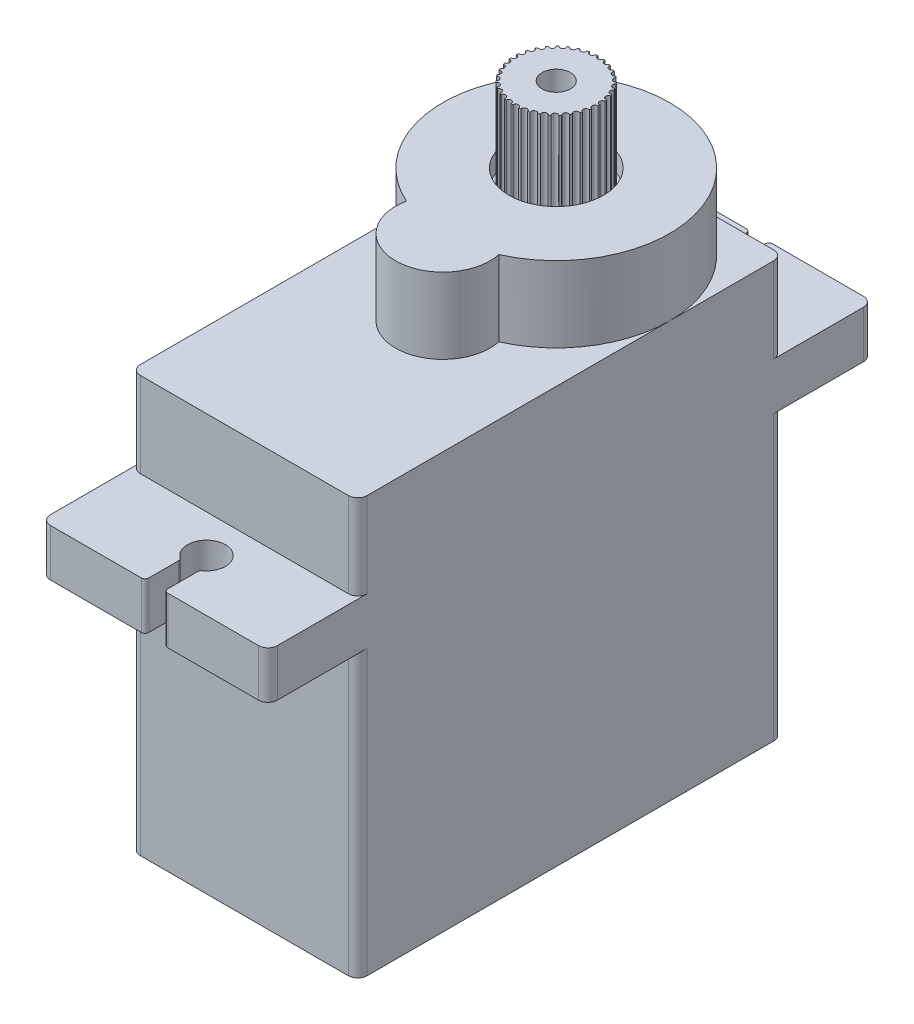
from build123d import *

# Parameters (mm, degrees)
Y_KSEKLIK_EKSTR_ZYON1_DEPTH  = 1
Y_KSEKLIK_EKSTR_ZYON2_DEPTH  = 5
IZIM3_W                      = 4
IZIM3_H                      = 1
KES_EKSTR_ZYON1_DEPTH        = 1
RADYUS1_R                    = 0.1
Y_KSEKLIK_EKSTR_ZYON4_DEPTH  = 9
Y_KSEKLIK_EKSTR_ZYON5_DEPTH  = 2.5
Y_KSEKLIK_EKSTR_ZYON6_DEPTH  = 3.5
Y_KSEKLIK_EKSTR_ZYON7_DEPTH  = 1
KES_EKSTR_ZYON2_DEPTH        = 1
Y_KSEKLIK_EKSTR_ZYON8_START  = 3
Y_KSEKLIK_EKSTR_ZYON8_DEPTH  = 3
RADYUS2_R                    = 0.5
Y_KSEKLIK_EKSTR_ZYON9_START  = 1
Y_KSEKLIK_EKSTR_ZYON9_DEPTH  = 1
IZIM11_R                     = 2.5
KES_EKSTR_ZYON3_DEPTH        = 10
IZIM15_R                     = 0.25
Y_KSEKLIK_EKSTR_ZYON12_DEPTH = 11
IZIM19_R                     = 2.25
Y_KSEKLIK_EKSTR_ZYON17_DEPTH = 5
IZIM20_R                     = 4.75
Y_KSEKLIK_EKSTR_ZYON18_DEPTH = 3
IZIM21_R                     = 0.75
KES_EKSTR_ZYON5_DEPTH        = 10
IZIM22_R                     = 0.5
Y_KSEKLIK_EKSTR_ZYON19_DEPTH = 5
IZIM23_R                     = 4
Y_KSEKLIK_EKSTR_ZYON20_DEPTH = 2
IZIM24_R                     = 0.75
Y_KSEKLIK_EKSTR_ZYON21_DEPTH = 7
IZIM25_R                     = 3.5
Y_KSEKLIK_EKSTR_ZYON22_DEPTH = 1
IZIM26_R                     = 4.5
Y_KSEKLIK_EKSTR_ZYON23_DEPTH = 1
KES_EKSTR_ZYON7_DEPTH        = 30
Y_KSEKLIK_EKSTR_ZYON33_DEPTH = 1
Y_KSEKLIK_EKSTR_ZYON34_DEPTH = 14
IZIM37_W                     = 8
IZIM37_H                     = 6
Y_KSEKLIK_EKSTR_ZYON36_DEPTH = 1
IZIM39_W                     = 4
IZIM39_H                     = 1
Y_KSEKLIK_EKSTR_ZYON37_DEPTH = 0.1
IZIM40_R                     = 0.4
Y_KSEKLIK_EKSTR_ZYON38_DEPTH = 2
IZIM41_R                     = 0.15
KES_EKSTR_ZYON8_DEPTH        = 5


with BuildPart() as part:
    # izim1 → Y_kseklik-Ekstr_zyon1 (new body)
    with BuildSketch(Plane(origin=(0, 0, 0), x_dir=(1, 0, 0), z_dir=(0, 1, 0))):
        with BuildLine():
            Line((-5.5, 11.25), (5.5, 11.25))
            ThreePointArc((5.5, 11.25), (5.853553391, 11.103553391), (6, 10.75))
            Line((6, 10.75), (6, -10.75))
            ThreePointArc((6, -10.75), (5.853553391, -11.103553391), (5.5, -11.25))
            Line((5.5, -11.25), (-5.5, -11.25))
            ThreePointArc((-5.5, -11.25), (-5.853553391, -11.103553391), (-6, -10.75))
            Line((-6, -10.75), (-6, 10.75))
            ThreePointArc((-6, 10.75), (-5.853553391, 11.103553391), (-5.5, 11.25))
        make_face()
    extrude(amount=Y_KSEKLIK_EKSTR_ZYON1_DEPTH)

    # izim2 → Y_kseklik-Ekstr_zyon2 (add)
    with BuildSketch(Plane(origin=(0, 1, 0), x_dir=(1, 0, 0), z_dir=(0, 1, 0))):
        with BuildLine():
            Line((-5.5, 11.25), (5.5, 11.25))
            ThreePointArc((5.5, 11.25), (5.853553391, 11.103553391), (6, 10.75))
            Line((6, 10.75), (6, -10.75))
            ThreePointArc((6, -10.75), (5.853553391, -11.103553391), (5.5, -11.25))
            Line((5.5, -11.25), (-5.5, -11.25))
            ThreePointArc((-5.5, -11.25), (-5.853553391, -11.103553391), (-6, -10.75))
            Line((-6, -10.75), (-6, 10.75))
            ThreePointArc((-6, 10.75), (-5.853553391, 11.103553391), (-5.5, 11.25))
        make_face()
        with BuildLine():
            Line((-5, 9.25), (-5, -9.25))
            ThreePointArc((-5, -9.25), (-4.292893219, -9.542893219), (-4, -10.25))
            Line((-4, -10.25), (4, -10.25))
            ThreePointArc((4, -10.25), (4.292893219, -9.542893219), (5, -9.25))
            Line((5, -9.25), (5, 9.25))
            ThreePointArc((5, 9.25), (4.292893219, 9.542893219), (4, 10.25))
            Line((4, 10.25), (-4, 10.25))
            ThreePointArc((-4, 10.25), (-4.292893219, 9.542893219), (-5, 9.25))
        make_face(mode=Mode.SUBTRACT)
    extrude(amount=Y_KSEKLIK_EKSTR_ZYON2_DEPTH)

    # izim3 → Kes-Ekstr_zyon1 (cut)
    with BuildSketch(Plane(origin=(0, 6, 0), x_dir=(1, 0, 0), z_dir=(0, 1, 0))):
        with Locations((0, -10.75)):
            Rectangle(IZIM3_W, IZIM3_H)
    extrude(amount=-KES_EKSTR_ZYON1_DEPTH, mode=Mode.SUBTRACT)

    # Radyus1
    radyus1_edges = [part.edges().sort_by_distance(p)[0] for p in [
        (2, 5, 10.75),
        (-2, 5, 10.75),
    ]]
    fillet(radyus1_edges, radius=RADYUS1_R)

    # izim4 → Y_kseklik-Ekstr_zyon4 (add)
    with BuildSketch(Plane(origin=(0, 6, 0), x_dir=(1, 0, 0), z_dir=(0, 1, 0))):
        with BuildLine():
            Line((-5.5, 11.25), (5.5, 11.25))
            ThreePointArc((5.5, 11.25), (5.853553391, 11.103553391), (6, 10.75))
            Line((6, 10.75), (6, -10.75))
            ThreePointArc((6, -10.75), (5.853553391, -11.103553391), (5.5, -11.25))
            Line((5.5, -11.25), (-5.5, -11.25))
            ThreePointArc((-5.5, -11.25), (-5.853553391, -11.103553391), (-6, -10.75))
            Line((-6, -10.75), (-6, 10.75))
            ThreePointArc((-6, 10.75), (-5.853553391, 11.103553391), (-5.5, 11.25))
        make_face()
        with BuildLine():
            Line((-4, 10.25), (4, 10.25))
            ThreePointArc((4, 10.25), (4.292893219, 9.542893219), (5, 9.25))
            Line((5, 9.25), (5, -9.25))
            ThreePointArc((5, -9.25), (4.292893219, -9.542893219), (4, -10.25))
            Line((4, -10.25), (-4, -10.25))
            ThreePointArc((-4, -10.25), (-4.292893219, -9.542893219), (-5, -9.25))
            Line((-5, -9.25), (-5, 9.25))
            ThreePointArc((-5, 9.25), (-4.292893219, 9.542893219), (-4, 10.25))
        make_face(mode=Mode.SUBTRACT)
    extrude(amount=Y_KSEKLIK_EKSTR_ZYON4_DEPTH)

    # izim6 → Y_kseklik-Ekstr_zyon5 (add)
    with BuildSketch(Plane(origin=(0, 15, 0), x_dir=(1, 0, 0), z_dir=(0, 1, 0))):
        with BuildLine():
            Line((-5.5, 16), (-0.7, 16))
            ThreePointArc((-0.7, 16), (-0.558578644, 15.941421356), (-0.5, 15.8))
            Line((-0.5, 15.8), (-0.5, 14.224679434))
            ThreePointArc((-0.5, 14.224679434), (-0.522048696, 14.133392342), (-0.583333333, 14.062232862))
            ThreePointArc((-0.583333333, 14.062232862), (0, 12.25), (0.583333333, 14.062232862))
            ThreePointArc((0.583333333, 14.062232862), (0.522048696, 14.133392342), (0.5, 14.224679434))
            Line((0.5, 14.224679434), (0.5, 15.8))
            ThreePointArc((0.5, 15.8), (0.558578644, 15.941421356), (0.7, 16))
            Line((0.7, 16), (5.5, 16))
            ThreePointArc((5.5, 16), (5.853553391, 15.853553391), (6, 15.5))
            Line((6, 15.5), (6, -15.5))
            ThreePointArc((6, -15.5), (5.853553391, -15.853553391), (5.5, -16))
            Line((5.5, -16), (0.7, -16))
            ThreePointArc((0.7, -16), (0.558578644, -15.941421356), (0.5, -15.8))
            Line((0.5, -15.8), (0.5, -14.224679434))
            ThreePointArc((0.5, -14.224679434), (0.522048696, -14.133392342), (0.583333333, -14.062232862))
            ThreePointArc((0.583333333, -14.062232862), (0, -12.25), (-0.583333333, -14.062232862))
            ThreePointArc((-0.583333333, -14.062232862), (-0.522048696, -14.133392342), (-0.5, -14.224679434))
            Line((-0.5, -14.224679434), (-0.5, -15.8))
            ThreePointArc((-0.5, -15.8), (-0.558578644, -15.941421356), (-0.7, -16))
            Line((-0.7, -16), (-5.5, -16))
            ThreePointArc((-5.5, -16), (-5.853553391, -15.853553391), (-6, -15.5))
            Line((-6, -15.5), (-6, 15.5))
            ThreePointArc((-6, 15.5), (-5.853553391, 15.853553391), (-5.5, 16))
        make_face()
        with BuildLine():
            Line((-4, 10.25), (4, 10.25))
            ThreePointArc((4, 10.25), (4.292893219, 9.542893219), (5, 9.25))
            Line((5, 9.25), (5, -9.25))
            ThreePointArc((5, -9.25), (4.292893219, -9.542893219), (4, -10.25))
            Line((4, -10.25), (-4, -10.25))
            ThreePointArc((-4, -10.25), (-4.292893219, -9.542893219), (-5, -9.25))
            Line((-5, -9.25), (-5, 9.25))
            ThreePointArc((-5, 9.25), (-4.292893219, 9.542893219), (-4, 10.25))
        make_face(mode=Mode.SUBTRACT)
    extrude(amount=Y_KSEKLIK_EKSTR_ZYON5_DEPTH)

    # izim7 → Y_kseklik-Ekstr_zyon6 (add)
    with BuildSketch(Plane(origin=(0, 17.5, 0), x_dir=(1, 0, 0), z_dir=(0, 1, 0))):
        with BuildLine():
            Line((5.5, 11.25), (-5.5, 11.25))
            ThreePointArc((-5.5, 11.25), (-5.853553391, 11.103553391), (-6, 10.75))
            Line((-6, 10.75), (-6, -10.75))
            ThreePointArc((-6, -10.75), (-5.853553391, -11.103553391), (-5.5, -11.25))
            Line((-5.5, -11.25), (5.5, -11.25))
            ThreePointArc((5.5, -11.25), (5.853553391, -11.103553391), (6, -10.75))
            Line((6, -10.75), (6, 10.75))
            ThreePointArc((6, 10.75), (5.853553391, 11.103553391), (5.5, 11.25))
        make_face()
        with BuildLine():
            Line((-5, -9.25), (-5, 9.25))
            ThreePointArc((-5, 9.25), (-4.292893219, 9.542893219), (-4, 10.25))
            Line((-4, 10.25), (4, 10.25))
            ThreePointArc((4, 10.25), (4.292893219, 9.542893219), (5, 9.25))
            Line((5, 9.25), (5, -9.25))
            ThreePointArc((5, -9.25), (4.292893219, -9.542893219), (4, -10.25))
            Line((4, -10.25), (-4, -10.25))
            ThreePointArc((-4, -10.25), (-4.292893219, -9.542893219), (-5, -9.25))
        make_face(mode=Mode.SUBTRACT)
    extrude(amount=Y_KSEKLIK_EKSTR_ZYON6_DEPTH)

    # izim8 → Y_kseklik-Ekstr_zyon7 (add)
    with BuildSketch(Plane(origin=(0, 21, 0), x_dir=(1, 0, 0), z_dir=(0, 1, 0))):
        with BuildLine():
            Line((-5.5, 11.25), (5.5, 11.25))
            ThreePointArc((5.5, 11.25), (5.853553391, 11.103553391), (6, 10.75))
            Line((6, 10.75), (6, -10.75))
            ThreePointArc((6, -10.75), (5.853553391, -11.103553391), (5.5, -11.25))
            Line((5.5, -11.25), (-5.5, -11.25))
            ThreePointArc((-5.5, -11.25), (-5.853553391, -11.103553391), (-6, -10.75))
            Line((-6, -10.75), (-6, 10.75))
            ThreePointArc((-6, 10.75), (-5.853553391, 11.103553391), (-5.5, 11.25))
        make_face()
    extrude(amount=Y_KSEKLIK_EKSTR_ZYON7_DEPTH)

    # izim9 → Kes-Ekstr_zyon2 (cut)
    with BuildSketch(Plane(origin=(0, 22, 0), x_dir=(1, 0, 0), z_dir=(0, 1, 0))):
        with BuildLine():
            ThreePointArc((1.015291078, 0.354166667), (0, 10.25), (-1.015291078, 0.354166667))
            ThreePointArc((-1.015291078, 0.354166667), (0, -2.25), (1.015291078, 0.354166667))
        make_face()
    extrude(amount=-KES_EKSTR_ZYON2_DEPTH, mode=Mode.SUBTRACT)

    # izim9_3 → Y_kseklik-Ekstr_zyon8 (add)
    with BuildSketch(Plane(origin=(0, 22, 0), x_dir=(1, 0, 0), z_dir=(0, 1, 0)).offset(Y_KSEKLIK_EKSTR_ZYON8_START)):
        with BuildLine():
            ThreePointArc((2.445144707, -0.229166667), (0, 11.25), (-2.445144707, -0.229166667))
            ThreePointArc((-2.445144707, -0.229166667), (0, -3.25), (2.445144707, -0.229166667))
        make_face()
        with BuildLine():
            ThreePointArc((1.015291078, 0.354166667), (0, 10.25), (-1.015291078, 0.354166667))
            ThreePointArc((-1.015291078, 0.354166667), (0, -2.25), (1.015291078, 0.354166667))
        make_face(mode=Mode.SUBTRACT)
    extrude(amount=-Y_KSEKLIK_EKSTR_ZYON8_DEPTH)

    # Radyus2
    radyus2_edges = [part.edges().sort_by_distance(p)[0] for p in [
        (-1.015291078, 23, -0.354166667),
        (1.015291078, 23, -0.354166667),
    ]]
    fillet(radyus2_edges, radius=RADYUS2_R)

    # izim10 → Y_kseklik-Ekstr_zyon9 (add)
    with BuildSketch(Plane(origin=(0, 25, 0), x_dir=(1, 0, 0), z_dir=(0, 1, 0)).offset(Y_KSEKLIK_EKSTR_ZYON9_START)):
        with BuildLine():
            ThreePointArc((2.445144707, -0.229166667), (0, 11.25), (-2.445144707, -0.229166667))
            ThreePointArc((-2.445144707, -0.229166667), (0, -3.25), (2.445144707, -0.229166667))
        make_face()
    extrude(amount=-Y_KSEKLIK_EKSTR_ZYON9_DEPTH)

    # izim11 → Kes-Ekstr_zyon3 (cut)
    with BuildSketch(Plane(origin=(0, 26, 0), x_dir=(1, 0, 0), z_dir=(0, 1, 0))):
        with Locations(Location((0, 5.25, 0), (0, 0, 270))):
            Circle(IZIM11_R)
    extrude(amount=-KES_EKSTR_ZYON3_DEPTH, mode=Mode.SUBTRACT)

    # izim15 → Y_kseklik-Ekstr_zyon12 (add)
    with BuildSketch(Plane(origin=(0, 26, 0), x_dir=(1, 0, 0), z_dir=(0, 1, 0))):
        with Locations(Location((0, -0.75, 0), (0, 0, 270))):
            Circle(IZIM15_R)
    extrude(amount=-Y_KSEKLIK_EKSTR_ZYON12_DEPTH)



with BuildPart() as body_2:
    # izim19 → Y_kseklik-Ekstr_zyon17 (new body)
    with BuildSketch(Plane(origin=(0, 30, 0), x_dir=(1, 0, 0), z_dir=(0, 1, 0))):
        with Locations(Location((0, 5.25, 0), (0, 0, 270))):
            Circle(IZIM19_R)
    extrude(amount=-Y_KSEKLIK_EKSTR_ZYON17_DEPTH)


with BuildPart() as part_1:
    add(part.part)

    add(body_2.part)  # Y_kseklik-Ekstr_zyon18 merges body 2
    # izim20 → Y_kseklik-Ekstr_zyon18 (add)
    with BuildSketch(Plane.XZ.offset(-25)):
        with Locations(Location((0, -5.25, 0), (0, 0, 90))):
            Circle(IZIM20_R)
    extrude(amount=Y_KSEKLIK_EKSTR_ZYON18_DEPTH)

    # izim21 → Kes-Ekstr_zyon5 (cut)
    with BuildSketch(Plane(origin=(0, 30, 0), x_dir=(1, 0, 0), z_dir=(0, 1, 0))):
        with Locations(Location((0, 5.25, 0), (0, 0, 270))):
            Circle(IZIM21_R)
    extrude(amount=-KES_EKSTR_ZYON5_DEPTH, mode=Mode.SUBTRACT)

    # izim22 → Y_kseklik-Ekstr_zyon19 (add)
    with BuildSketch(Plane(origin=(0, 25.5, 0), x_dir=(1, 0, 0), z_dir=(0, 1, 0))):
        with Locations(Location((0, -0.75, 0), (0, 0, 270))):
            Circle(IZIM22_R)
    extrude(amount=-Y_KSEKLIK_EKSTR_ZYON19_DEPTH)

    # izim23 → Y_kseklik-Ekstr_zyon20 (add)
    with BuildSketch(Plane.XZ.offset(-20.5)):
        with Locations(Location((0, 0.75, 0), (0, 0, 270))):
            Circle(IZIM23_R)
    extrude(amount=Y_KSEKLIK_EKSTR_ZYON20_DEPTH)

    # izim26 → Y_kseklik-Ekstr_zyon23 (add)
    with BuildSketch(Plane(origin=(0, 17.5, 0), x_dir=(-1, 0, 0), z_dir=(0, -1, 0))):
        with Locations(Location((0, -0.75, 0), (0, 0, 90))):
            Circle(IZIM26_R)
    extrude(amount=Y_KSEKLIK_EKSTR_ZYON23_DEPTH)

    # izim32 → Kes-Ekstr_zyon7 (cut)
    with BuildSketch(Plane(origin=(0, 0, 10.25), x_dir=(-1, 0, 0), z_dir=(0, 0, -1))):
        with BuildLine():
            Line((2, 6), (-2, 6))
            Line((-2, 6), (-2, 5.1))
            ThreePointArc((-2, 5.1), (-1.970710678, 5.029289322), (-1.9, 5))
            Line((-1.9, 5), (1.9, 5))
            ThreePointArc((1.9, 5), (1.970710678, 5.029289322), (2, 5.1))
            Line((2, 5.1), (2, 6))
        make_face()
    extrude(amount=KES_EKSTR_ZYON7_DEPTH, mode=Mode.SUBTRACT)

    # izim33 → Y_kseklik-Ekstr_zyon33 (add)
    with BuildSketch(Plane.XY.offset(11.25)):
        with BuildLine():
            Line((-2, 6), (2, 6))
            Line((2, 6), (2, 5.1))
            ThreePointArc((2, 5.1), (1.970710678, 5.029289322), (1.9, 5))
            Line((1.9, 5), (-1.9, 5))
            ThreePointArc((-1.9, 5), (-1.970710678, 5.029289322), (-2, 5.1))
            Line((-2, 5.1), (-2, 6))
        make_face()
    extrude(amount=-Y_KSEKLIK_EKSTR_ZYON33_DEPTH)

    # izim34 → Y_kseklik-Ekstr_zyon34 (add)
    with BuildSketch(Plane(origin=(0, 1, 0), x_dir=(1, 0, 0), z_dir=(0, 1, 0))):
        with BuildLine():
            Line((-3, -3.25), (3, -3.25))
            ThreePointArc((3, -3.25), (3.707106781, -3.542893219), (4, -4.25))
            Line((4, -4.25), (4, -8.25))
            ThreePointArc((4, -8.25), (3.707106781, -8.957106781), (3, -9.25))
            Line((3, -9.25), (-3, -9.25))
            ThreePointArc((-3, -9.25), (-3.707106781, -8.957106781), (-4, -8.25))
            Line((-4, -8.25), (-4, -4.25))
            ThreePointArc((-4, -4.25), (-3.707106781, -3.542893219), (-3, -3.25))
        make_face()
    extrude(amount=Y_KSEKLIK_EKSTR_ZYON34_DEPTH)

    # izim37 → Y_kseklik-Ekstr_zyon36 (add)
    with BuildSketch(Plane(origin=(0, 1, 0), x_dir=(-1, 0, 0), z_dir=(0, -1, 0))):
        with Locations((0, -6.25)):
            Rectangle(IZIM37_W, IZIM37_H)
    extrude(amount=-Y_KSEKLIK_EKSTR_ZYON36_DEPTH)

    # izim39 → Y_kseklik-Ekstr_zyon37 (add)
    with BuildSketch(Plane(origin=(0, 0, -10.75), x_dir=(-1, 0, 0), z_dir=(0, 0, -1))):
        with Locations((0, 5.514566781)):
            Rectangle(IZIM39_W, IZIM39_H)
    extrude(amount=Y_KSEKLIK_EKSTR_ZYON37_DEPTH)

    # izim40 → Y_kseklik-Ekstr_zyon38 (add)
    with BuildSketch(Plane(origin=(0, 0, -10.85), x_dir=(-1, 0, 0), z_dir=(0, 0, -1))):
        with Locations((0, 5.55)):
            Circle(IZIM40_R)
        with Locations((1, 5.55)):
            Circle(IZIM40_R)
        with Locations((-1, 5.55)):
            Circle(IZIM40_R)
    extrude(amount=Y_KSEKLIK_EKSTR_ZYON38_DEPTH)

    # izim41 → Kes-Ekstr_zyon8 (cut)
    with BuildSketch(Plane(origin=(0, 30, 0), x_dir=(1, 0, 0), z_dir=(0, 1, 0))):
        with Locations((-2.25, 5.25)):
            Circle(IZIM41_R)
        with Locations((-2.213841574, 5.651753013)):
            Circle(IZIM41_R)
        with Locations((-2.106528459, 6.040593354)):
            Circle(IZIM41_R)
        with Locations((-1.931509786, 6.404023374)):
            Circle(IZIM41_R)
        with Locations((-1.694410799, 6.730362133)):
            Circle(IZIM41_R)
        with Locations((-1.402852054, 7.009120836)):
            Circle(IZIM41_R)
        with Locations((-1.066204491, 7.231339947)):
            Circle(IZIM41_R)
        with Locations((-0.695288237, 7.389877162)):
            Circle(IZIM41_R)
        with Locations((-0.302024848, 7.479636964)):
            Circle(IZIM41_R)
        with Locations((0.100945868, 7.4977344)):
            Circle(IZIM41_R)
        with Locations((0.500672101, 7.443587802)):
            Circle(IZIM41_R)
        with Locations((0.884306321, 7.318937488)):
            Circle(IZIM41_R)
        with Locations((1.239518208, 7.127789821)):
            Circle(IZIM41_R)
        with Locations((1.55489096, 6.876288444)):
            Circle(IZIM41_R)
        with Locations((1.820288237, 6.572516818)):
            Circle(IZIM41_R)
        with Locations((2.027179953, 6.226238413)):
            Circle(IZIM41_R)
        with Locations((2.168916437, 5.848582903)):
            Circle(IZIM41_R)
        with Locations((2.240942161, 5.451688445)):
            Circle(IZIM41_R)
        with Locations((2.240942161, 5.048311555)):
            Circle(IZIM41_R)
        with Locations((2.168916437, 4.651417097)):
            Circle(IZIM41_R)
        with Locations((2.027179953, 4.273761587)):
            Circle(IZIM41_R)
        with Locations((1.820288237, 3.927483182)):
            Circle(IZIM41_R)
        with Locations((1.55489096, 3.623711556)):
            Circle(IZIM41_R)
        with Locations((1.239518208, 3.372210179)):
            Circle(IZIM41_R)
        with Locations((0.884306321, 3.181062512)):
            Circle(IZIM41_R)
        with Locations((0.500672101, 3.056412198)):
            Circle(IZIM41_R)
        with Locations((0.100945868, 3.0022656)):
            Circle(IZIM41_R)
        with Locations((-0.302024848, 3.020363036)):
            Circle(IZIM41_R)
        with Locations((-0.695288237, 3.110122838)):
            Circle(IZIM41_R)
        with Locations((-1.066204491, 3.268660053)):
            Circle(IZIM41_R)
        with Locations((-1.402852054, 3.490879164)):
            Circle(IZIM41_R)
        with Locations((-1.694410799, 3.769637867)):
            Circle(IZIM41_R)
        with Locations((-1.931509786, 4.095976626)):
            Circle(IZIM41_R)
        with Locations((-2.106528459, 4.459406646)):
            Circle(IZIM41_R)
        with Locations((-2.213841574, 4.848246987)):
            Circle(IZIM41_R)
    extrude(amount=-KES_EKSTR_ZYON8_DEPTH, mode=Mode.SUBTRACT)


with BuildPart() as body_2_2:
    # izim24 → Y_kseklik-Ekstr_zyon21 (new body)
    with BuildSketch(Plane.XZ.offset(-22)):
        with Locations(Location((0, -5.25, 0), (0, 0, 270))):
            Circle(IZIM24_R)
    extrude(amount=Y_KSEKLIK_EKSTR_ZYON21_DEPTH)

    # izim25 → Y_kseklik-Ekstr_zyon22 (add)
    with BuildSketch(Plane(origin=(0, 19, 0), x_dir=(-1, 0, 0), z_dir=(0, -1, 0))):
        with Locations(Location((0, 5.25, 0), (0, 0, 90))):
            Circle(IZIM25_R)
    extrude(amount=Y_KSEKLIK_EKSTR_ZYON22_DEPTH)


solid = Compound([part_1.part, body_2_2.part])
